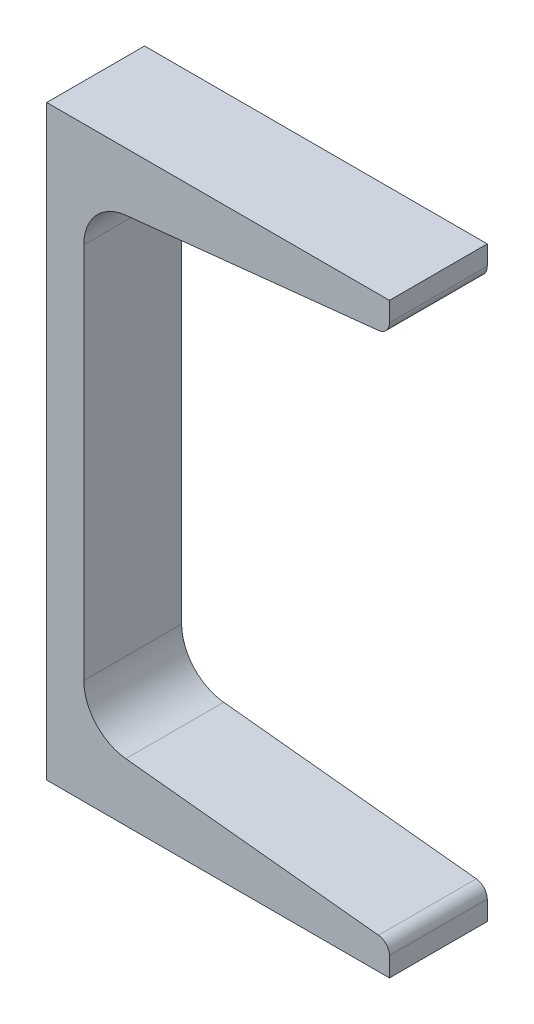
from build123d import *

# Parameters (mm, degrees)
BASEMCHANNEL_DEPTH = 12.7
TOEFILLET_R        = 3.175


with BuildPart() as part:
    # Sketch1 → BaseMchannel (new, symmetric)
    with BuildSketch(Plane.XY):
        with BuildLine():
            Line((89.0016, 152.4), (0, 152.4))
            Line((0, 152.4), (0, 0))
            Line((0, 0), (89.0016, 0))
            Line((89.0016, 0), (89.0016, 7.893675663))
            Line((89.0016, 7.893675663), (20.544188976, 15.088839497))
            ThreePointArc((20.544188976, 15.088839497), (12.758178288, 19.056010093), (9.6266, 27.214050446))
            Line((9.6266, 27.214050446), (9.6266, 125.185949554))
            ThreePointArc((9.6266, 125.185949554), (12.758178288, 133.343989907), (20.544188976, 137.311160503))
            Line((20.544188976, 137.311160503), (89.0016, 144.506324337))
            Line((89.0016, 144.506324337), (89.0016, 152.4))
        make_face()
    extrude(amount=BASEMCHANNEL_DEPTH, both=True)

    # ToeFillet
    toefillet_edges = [part.edges().sort_by_distance(p)[0] for p in [
        (89.0016, 144.506324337, 0),
        (89.0016, 7.893675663, 0),
    ]]
    fillet(toefillet_edges, radius=TOEFILLET_R)


solid = part.part
